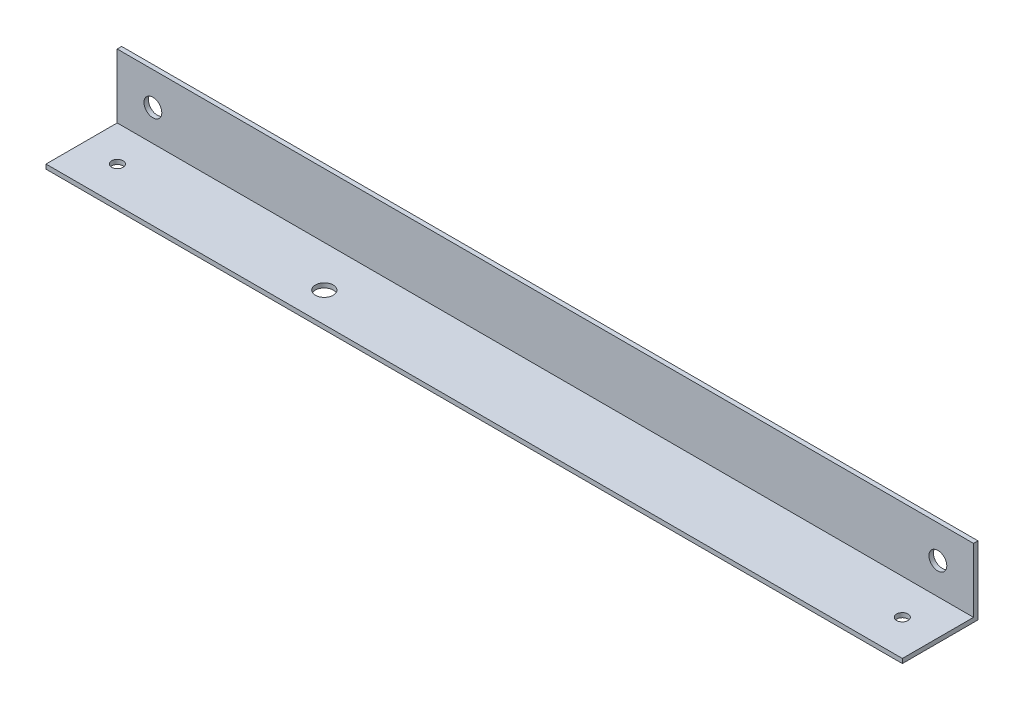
from build123d import *

# Parameters (mm, degrees)
SKETCH1_W           = 304.8
SKETCH1_H           = 24.384
BOSS_EXTRUDE1_DEPTH = 26.924
SKETCH2_W           = 304.8
SKETCH2_H           = 25.3365
CUT_EXTRUDE1_DEPTH  = 12.7
SKETCH3_W           = 304.8
SKETCH3_H           = 10.0965
CUT_EXTRUDE3_DEPTH  = 25.3365
SKETCH4_R           = 3.175
CUT_EXTRUDE4_DEPTH  = 2.54
SKETCH5_R           = 2.032
CUT_EXTRUDE5_DEPTH  = 2.54
SKETCH6_R           = 3.175
CUT_EXTRUDE6_DEPTH  = 2.54


with BuildPart() as part:
    # Sketch1 → Boss-Extrude1 (new body)
    with BuildSketch(Plane.XY):
        with Locations((-57.426086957, 55.646509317)):
            Rectangle(SKETCH1_W, SKETCH1_H)
    extrude(amount=BOSS_EXTRUDE1_DEPTH)

    # Sketch2 → Cut-Extrude1 (cut)
    with BuildSketch(Plane(origin=(0, 67.838509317, 0), x_dir=(1, 0, 0), z_dir=(0, 1, 0))):
        with Locations((-57.426086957, -14.25575)):
            Rectangle(SKETCH2_W, SKETCH2_H)
    extrude(amount=-CUT_EXTRUDE1_DEPTH, mode=Mode.SUBTRACT)

    # Sketch3 → Cut-Extrude3 (cut)
    with BuildSketch(Plane.XY.offset(26.924)):
        with Locations((-57.426086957, 50.090259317)):
            Rectangle(SKETCH3_W, SKETCH3_H)
    extrude(amount=-CUT_EXTRUDE3_DEPTH, mode=Mode.SUBTRACT)

    # Sketch4 → Cut-Extrude4 (cut)
    with BuildSketch(Plane(origin=(0, 0, 0), x_dir=(-1, 0, 0), z_dir=(0, 0, -1))):
        with Locations((-82.273913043, 56.154509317)):
            Circle(SKETCH4_R)
        with Locations((197.126086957, 56.154509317)):
            Circle(SKETCH4_R)
    extrude(amount=-CUT_EXTRUDE4_DEPTH, mode=Mode.SUBTRACT)

    # Sketch5 → Cut-Extrude5 (cut)
    with BuildSketch(Plane.XZ.offset(-43.454509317)):
        with Locations(Location((-197.126086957, 14.224, 0), (0, 0, 270))):
            Circle(SKETCH5_R)
        with Locations(Location((82.273913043, 14.224, 0), (0, 0, 270))):
            Circle(SKETCH5_R)
    extrude(amount=-CUT_EXTRUDE5_DEPTH, mode=Mode.SUBTRACT)

    # Sketch6 → Cut-Extrude6 (cut)
    with BuildSketch(Plane.XZ.offset(-43.454509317)):
        with Locations(Location((-121.433339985, 16.256, 0), (0, 0, 270))):
            Circle(SKETCH6_R)
    extrude(amount=-CUT_EXTRUDE6_DEPTH, mode=Mode.SUBTRACT)


solid = part.part
